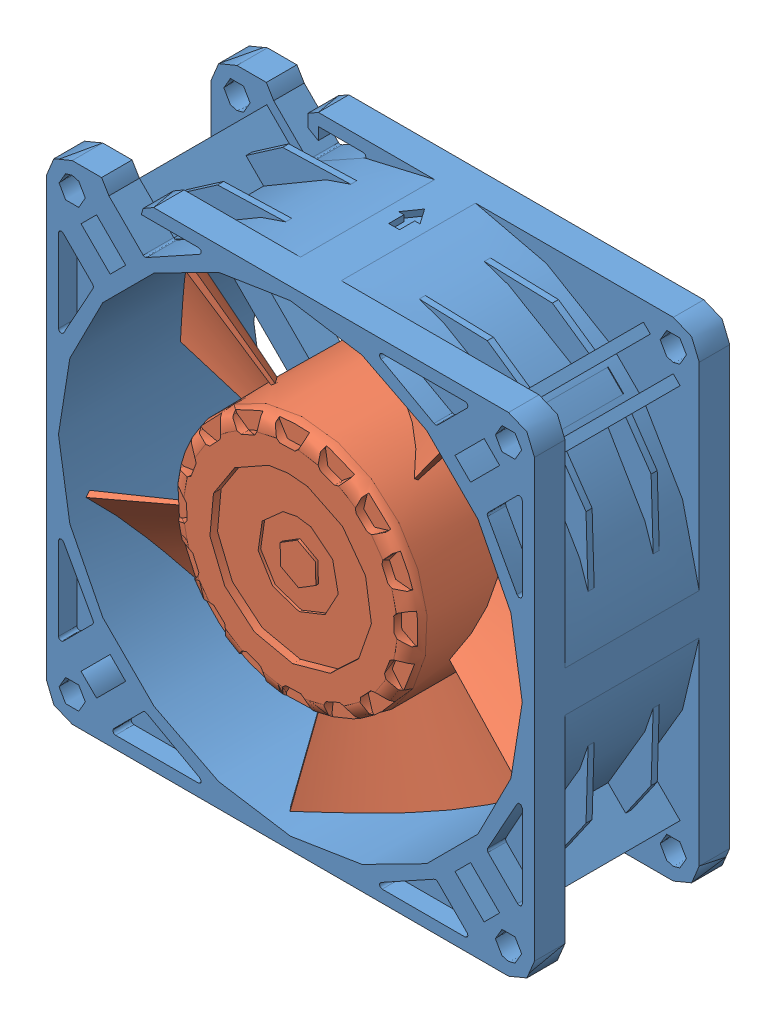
SolidWorks assembly Fan-S-Panter.SLDASM, configuration 8312 NL_ebm-papst (file format 4400). Lengths in mm.
Overall size (80 80 32.13).
2 component instances, 2 part files, 2 mates.
Components (placement in the parent):
- Fan-House_8312_NL_ebm-papst-1: Fan-House_8312_NL_ebm-papst.sldprt [8312 NL_ebm-papst] at origin size (80 80 32)
- Fan_8312_NL_ebm-papst-1: Fan_8312_NL_ebm-papst.sldprt [8312 NL_ebm-papst] x (0 0 -1) z (0.028627 -0.99959 0) size (32.13 74 74)
Mates (geometry in assembly coordinates):
- Coincident1: coincident anti-aligned: plane of Fan-House_8312_NL_ebm-papst-1 through (0 0 0) normal (0 0 1); plane of Fan_8312_NL_ebm-papst-1
- Coincident2: coincident aligned: axis of Fan_8312_NL_ebm-papst-1 through (0 0 39.862) axis (0 0 -1); axis of Fan-House_8312_NL_ebm-papst-1 through (0 0 32) axis (0 0 -1)
